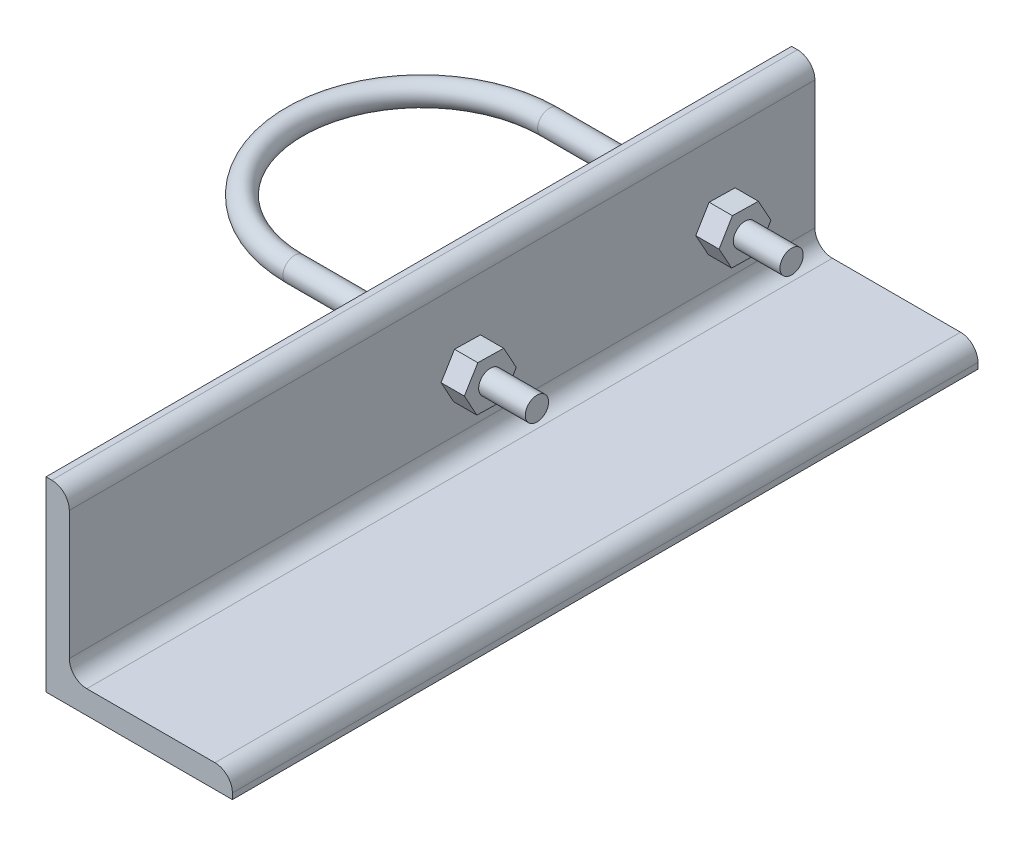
from build123d import *

# Parameters (mm, degrees)
BASESTEELANGLE_DEPTH = 101.6
EXTRUDE1_DEPTH       = 40.64
EXTRUDE1_DEPTH_BACK  = 25.4
SKETCH2_R            = 3.175
SKETCH3_R            = 3.175
REVOLVE1_ANGLE       = 180
EXTRUDE2_DEPTH       = 6.35


with BuildPart() as part:
    # Sketch1 → BaseSteelAngle (new, symmetric)
    with BuildSketch(Plane.XY):
        with BuildLine():
            Line((0, 0), (0, 50.8))
            Line((0, 50.8), (1.59258, 50.8))
            ThreePointArc((1.59258, 50.8), (4.956583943, 49.406583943), (6.35, 46.04258))
            Line((6.35, 46.04258), (6.35, 11.1125))
            ThreePointArc((6.35, 11.1125), (7.744903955, 7.744903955), (11.1125, 6.35))
            Line((11.1125, 6.35), (46.04258, 6.35))
            ThreePointArc((46.04258, 6.35), (49.406583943, 4.956583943), (50.8, 1.59258))
            Line((50.8, 1.59258), (50.8, 0))
            Line((50.8, 0), (0, 0))
        make_face()
    extrude(amount=BASESTEELANGLE_DEPTH, both=True)

    # Sketch2 → Extrude1 (add, two sides: drawn at the far end of the back side and taken through both)
    with BuildSketch(Plane.ZY.offset(-EXTRUDE1_DEPTH_BACK)):
        with Locations((-76.2, 25.4)):
            Circle(SKETCH2_R)
        with Locations((-6.792692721, 25.4)):
            Circle(SKETCH2_R)
    extrude(amount=EXTRUDE1_DEPTH + EXTRUDE1_DEPTH_BACK)

    # Sketch3 → Revolve1 (revolve)
    with BuildSketch(Plane(origin=(-40.64, 0, 0), x_dir=(0, 0, -1), z_dir=(1, 0, 0))):
        with Locations((76.2, 25.4)):
            Circle(SKETCH3_R)
    revolve(axis=Axis((-40.64, 25.4, -41.496346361), (0, 1, 0)), revolution_arc=REVOLVE1_ANGLE)

    # Sketch4 → Extrude2 (add)
    with BuildSketch(Plane.ZY.offset(-6.35)):
        Polygon((-83.271810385, 25.269665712), (-79.623032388, 19.210465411), (-72.551222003, 19.3407997), (-69.128189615, 25.530334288), (-72.776967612, 31.589534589), (-79.848777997, 31.4592003), align=None)
        Polygon((-13.864305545, 25.259354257), (-10.206696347, 19.205480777), (-3.135083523, 19.346126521), (0.278920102, 25.540645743), (-3.378689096, 31.594519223), (-10.45030192, 31.453873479), align=None)
    extrude(amount=-EXTRUDE2_DEPTH)


solid = part.part
